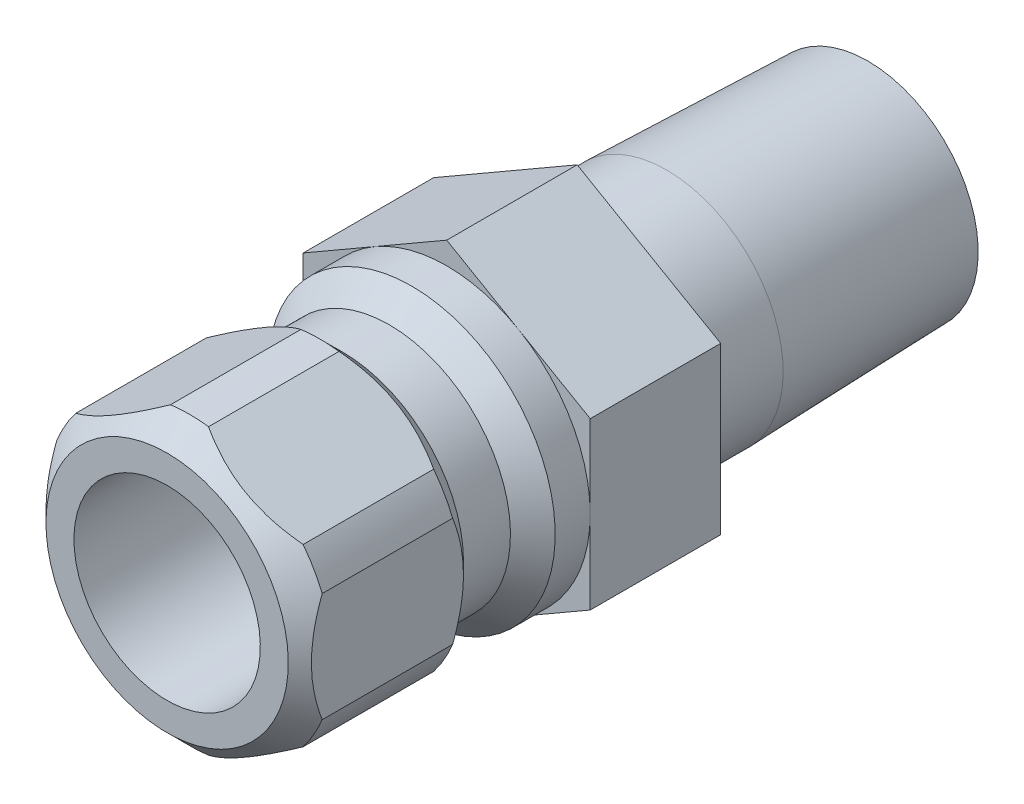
ISO-10303-21;
HEADER;
FILE_DESCRIPTION(('STEP AP214'),'2;1');
FILE_NAME('part.step','',(''),(''),'','','');
FILE_SCHEMA(('AUTOMOTIVE_DESIGN { 1 0 10303 214 1 1 1 1 }'));
ENDSEC;
DATA;
#1=APPLICATION_CONTEXT('core data for automotive mechanical design processes');
#2=APPLICATION_PROTOCOL_DEFINITION('international standard','automotive_design',2000,#1);
#3=PRODUCT_CONTEXT('',#1,'mechanical');
#4=PRODUCT('Part','Part','',(#3));
#5=PRODUCT_RELATED_PRODUCT_CATEGORY('part','',(#4));
#6=PRODUCT_DEFINITION_FORMATION('','',#4);
#7=PRODUCT_DEFINITION_CONTEXT('part definition',#1,'design');
#8=PRODUCT_DEFINITION('design','',#6,#7);
#9=PRODUCT_DEFINITION_SHAPE('','',#8);
#10=(LENGTH_UNIT() NAMED_UNIT(*) SI_UNIT(.MILLI.,.METRE.));
#11=(NAMED_UNIT(*) PLANE_ANGLE_UNIT() SI_UNIT($,.RADIAN.));
#12=(NAMED_UNIT(*) SI_UNIT($,.STERADIAN.) SOLID_ANGLE_UNIT());
#13=UNCERTAINTY_MEASURE_WITH_UNIT(LENGTH_MEASURE(1.E-05),#10,'distance_accuracy_value','');
#14=(GEOMETRIC_REPRESENTATION_CONTEXT(3) GLOBAL_UNCERTAINTY_ASSIGNED_CONTEXT((#13)) GLOBAL_UNIT_ASSIGNED_CONTEXT((#10,
#11,#12)) REPRESENTATION_CONTEXT('',''));
#15=CARTESIAN_POINT('',(0.,0.,0.));
#16=DIRECTION('',(0.,0.,1.));
#17=DIRECTION('',(1.,0.,0.));
#18=AXIS2_PLACEMENT_3D('',#15,#16,#17);
#19=CARTESIAN_POINT('',(0.,0.,0.));
#20=DIRECTION('',(0.,0.,-1.));
#21=DIRECTION('',(0.,1.,0.));
#22=AXIS2_PLACEMENT_3D('',#19,#20,#21);
#23=CYLINDRICAL_SURFACE('',#22,4.8895);
#24=DIRECTION('',(0.,0.,-1.));
#25=VECTOR('',#24,1.);
#26=CARTESIAN_POINT('',(-3.87288738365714,2.98461950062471,0.));
#27=LINE('',#26,#25);
#28=CARTESIAN_POINT('',(-3.87288738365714,2.98461950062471,4.318));
#29=VERTEX_POINT('',#28);
#30=CARTESIAN_POINT('',(-3.87288738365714,2.98461950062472,8.763));
#31=VERTEX_POINT('',#30);
#32=EDGE_CURVE('E54',#29,#31,#27,.F.);
#33=ORIENTED_EDGE('',*,*,#32,.F.);
#34=CARTESIAN_POINT('',(0.,0.,4.318));
#35=DIRECTION('',(0.,0.,-1.));
#36=DIRECTION('',(0.,1.,0.));
#37=AXIS2_PLACEMENT_3D('',#34,#35,#36);
#38=CIRCLE('',#37,4.8895);
#39=CARTESIAN_POINT('',(-4.5212,1.86170910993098,4.318));
#40=VERTEX_POINT('',#39);
#41=EDGE_CURVE('E213',#40,#29,#38,.T.);
#42=ORIENTED_EDGE('',*,*,#41,.F.);
#43=DIRECTION('',(0.,0.,-1.));
#44=VECTOR('',#43,1.);
#45=CARTESIAN_POINT('',(-4.5212,1.86170910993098,0.));
#46=LINE('',#45,#44);
#47=CARTESIAN_POINT('',(-4.5212,1.86170910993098,8.763));
#48=VERTEX_POINT('',#47);
#49=EDGE_CURVE('E428',#48,#40,#46,.T.);
#50=ORIENTED_EDGE('',*,*,#49,.F.);
#51=CARTESIAN_POINT('',(0.,0.,8.763));
#52=DIRECTION('',(0.,0.,-1.));
#53=DIRECTION('',(0.,1.,0.));
#54=AXIS2_PLACEMENT_3D('',#51,#52,#53);
#55=CIRCLE('',#54,4.8895);
#56=EDGE_CURVE('E218',#48,#31,#55,.T.);
#57=ORIENTED_EDGE('',*,*,#56,.T.);
#58=EDGE_LOOP('',(#33,#42,#50,#57));
#59=FACE_BOUND('',#58,.T.);
#60=ADVANCED_FACE('F35',(#59),#23,.T.);
#61=DIRECTION('',(0.,0.,-1.));
#62=VECTOR('',#61,1.);
#63=CARTESIAN_POINT('',(-4.5212,-1.86170910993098,0.));
#64=LINE('',#63,#62);
#65=CARTESIAN_POINT('',(-4.5212,-1.86170910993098,4.318));
#66=VERTEX_POINT('',#65);
#67=CARTESIAN_POINT('',(-4.5212,-1.86170910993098,8.763));
#68=VERTEX_POINT('',#67);
#69=EDGE_CURVE('E62',#66,#68,#64,.F.);
#70=ORIENTED_EDGE('',*,*,#69,.F.);
#71=CARTESIAN_POINT('',(-3.87288738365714,-2.98461950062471,4.318));
#72=VERTEX_POINT('',#71);
#73=EDGE_CURVE('E486',#72,#66,#38,.T.);
#74=ORIENTED_EDGE('',*,*,#73,.F.);
#75=DIRECTION('',(0.,0.,-1.));
#76=VECTOR('',#75,1.);
#77=CARTESIAN_POINT('',(-3.87288738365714,-2.98461950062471,0.));
#78=LINE('',#77,#76);
#79=CARTESIAN_POINT('',(-3.87288738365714,-2.98461950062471,8.763));
#80=VERTEX_POINT('',#79);
#81=EDGE_CURVE('E423',#80,#72,#78,.T.);
#82=ORIENTED_EDGE('',*,*,#81,.F.);
#83=EDGE_CURVE('E223',#80,#68,#55,.T.);
#84=ORIENTED_EDGE('',*,*,#83,.T.);
#85=EDGE_LOOP('',(#70,#74,#82,#84));
#86=FACE_BOUND('',#85,.T.);
#87=ADVANCED_FACE('F420',(#86),#23,.T.);
#88=DIRECTION('',(0.,0.,-1.));
#89=VECTOR('',#88,1.);
#90=CARTESIAN_POINT('',(-0.648312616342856,-4.84632861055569,0.));
#91=LINE('',#90,#89);
#92=CARTESIAN_POINT('',(-0.648312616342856,-4.84632861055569,4.318));
#93=VERTEX_POINT('',#92);
#94=CARTESIAN_POINT('',(-0.648312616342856,-4.84632861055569,8.763));
#95=VERTEX_POINT('',#94);
#96=EDGE_CURVE('E434',#93,#95,#91,.F.);
#97=ORIENTED_EDGE('',*,*,#96,.F.);
#98=CARTESIAN_POINT('',(0.648312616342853,-4.84632861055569,4.318));
#99=VERTEX_POINT('',#98);
#100=EDGE_CURVE('E484',#99,#93,#38,.T.);
#101=ORIENTED_EDGE('',*,*,#100,.F.);
#102=DIRECTION('',(0.,0.,-1.));
#103=VECTOR('',#102,1.);
#104=CARTESIAN_POINT('',(0.648312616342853,-4.84632861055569,0.));
#105=LINE('',#104,#103);
#106=CARTESIAN_POINT('',(0.648312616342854,-4.84632861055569,8.763));
#107=VERTEX_POINT('',#106);
#108=EDGE_CURVE('E470',#107,#99,#105,.T.);
#109=ORIENTED_EDGE('',*,*,#108,.F.);
#110=EDGE_CURVE('E216',#107,#95,#55,.T.);
#111=ORIENTED_EDGE('',*,*,#110,.T.);
#112=EDGE_LOOP('',(#97,#101,#109,#111));
#113=FACE_BOUND('',#112,.T.);
#114=ADVANCED_FACE('F483',(#113),#23,.T.);
#115=DIRECTION('',(0.,0.,-1.));
#116=VECTOR('',#115,1.);
#117=CARTESIAN_POINT('',(3.87288738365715,-2.98461950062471,0.));
#118=LINE('',#117,#116);
#119=CARTESIAN_POINT('',(3.87288738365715,-2.98461950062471,4.318));
#120=VERTEX_POINT('',#119);
#121=CARTESIAN_POINT('',(3.87288738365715,-2.98461950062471,8.763));
#122=VERTEX_POINT('',#121);
#123=EDGE_CURVE('E472',#120,#122,#118,.F.);
#124=ORIENTED_EDGE('',*,*,#123,.F.);
#125=CARTESIAN_POINT('',(4.5212,-1.86170910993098,4.318));
#126=VERTEX_POINT('',#125);
#127=EDGE_CURVE('E410',#126,#120,#38,.T.);
#128=ORIENTED_EDGE('',*,*,#127,.F.);
#129=DIRECTION('',(0.,0.,-1.));
#130=VECTOR('',#129,1.);
#131=CARTESIAN_POINT('',(4.5212,-1.86170910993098,0.));
#132=LINE('',#131,#130);
#133=CARTESIAN_POINT('',(4.5212,-1.86170910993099,8.763));
#134=VERTEX_POINT('',#133);
#135=EDGE_CURVE('E402',#134,#126,#132,.T.);
#136=ORIENTED_EDGE('',*,*,#135,.F.);
#137=EDGE_CURVE('E209',#134,#122,#55,.T.);
#138=ORIENTED_EDGE('',*,*,#137,.T.);
#139=EDGE_LOOP('',(#124,#128,#136,#138));
#140=FACE_BOUND('',#139,.T.);
#141=ADVANCED_FACE('F408',(#140),#23,.T.);
#142=DIRECTION('',(0.,0.,-1.));
#143=VECTOR('',#142,1.);
#144=CARTESIAN_POINT('',(4.5212,1.86170910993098,0.));
#145=LINE('',#144,#143);
#146=CARTESIAN_POINT('',(4.5212,1.86170910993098,4.318));
#147=VERTEX_POINT('',#146);
#148=CARTESIAN_POINT('',(4.5212,1.86170910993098,8.763));
#149=VERTEX_POINT('',#148);
#150=EDGE_CURVE('E404',#147,#149,#145,.F.);
#151=ORIENTED_EDGE('',*,*,#150,.F.);
#152=CARTESIAN_POINT('',(3.87288738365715,2.98461950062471,4.318));
#153=VERTEX_POINT('',#152);
#154=EDGE_CURVE('E202',#153,#147,#38,.T.);
#155=ORIENTED_EDGE('',*,*,#154,.F.);
#156=DIRECTION('',(0.,0.,-1.));
#157=VECTOR('',#156,1.);
#158=CARTESIAN_POINT('',(3.87288738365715,2.98461950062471,0.));
#159=LINE('',#158,#157);
#160=CARTESIAN_POINT('',(3.87288738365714,2.98461950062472,8.763));
#161=VERTEX_POINT('',#160);
#162=EDGE_CURVE('E184',#161,#153,#159,.T.);
#163=ORIENTED_EDGE('',*,*,#162,.F.);
#164=EDGE_CURVE('E200',#161,#149,#55,.T.);
#165=ORIENTED_EDGE('',*,*,#164,.T.);
#166=EDGE_LOOP('',(#151,#155,#163,#165));
#167=FACE_BOUND('',#166,.T.);
#168=ADVANCED_FACE('F199',(#167),#23,.T.);
#169=CARTESIAN_POINT('',(0.,0.,0.));
#170=DIRECTION('',(0.,0.,-1.));
#171=DIRECTION('',(0.,1.,0.));
#172=AXIS2_PLACEMENT_3D('',#169,#170,#171);
#173=CYLINDRICAL_SURFACE('',#172,4.8895);
#174=CARTESIAN_POINT('',(0.,0.,1.1938));
#175=DIRECTION('',(0.,0.,-1.));
#176=DIRECTION('',(0.,1.,0.));
#177=AXIS2_PLACEMENT_3D('',#174,#175,#176);
#178=CIRCLE('',#177,4.8895);
#179=CARTESIAN_POINT('',(0.,4.8895,1.1938));
#180=VERTEX_POINT('',#179);
#181=EDGE_CURVE('E494',#180,#180,#178,.T.);
#182=ORIENTED_EDGE('',*,*,#181,.T.);
#183=EDGE_LOOP('',(#182));
#184=FACE_BOUND('',#183,.T.);
#185=CARTESIAN_POINT('',(0.,0.,0.));
#186=DIRECTION('',(0.,0.,-1.));
#187=DIRECTION('',(0.,1.,0.));
#188=AXIS2_PLACEMENT_3D('',#185,#186,#187);
#189=CIRCLE('',#188,4.8895);
#190=CARTESIAN_POINT('',(2.44475,4.23443121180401,0.));
#191=VERTEX_POINT('',#190);
#192=CARTESIAN_POINT('',(4.8895,0.,0.));
#193=VERTEX_POINT('',#192);
#194=EDGE_CURVE('E497',#191,#193,#189,.T.);
#195=ORIENTED_EDGE('',*,*,#194,.F.);
#196=CARTESIAN_POINT('',(0.,0.,0.));
#197=DIRECTION('',(0.,0.,1.));
#198=DIRECTION('',(1.,0.,0.));
#199=AXIS2_PLACEMENT_3D('',#196,#197,#198);
#200=CIRCLE('',#199,4.8895);
#201=CARTESIAN_POINT('',(-2.44475,4.23443121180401,0.));
#202=VERTEX_POINT('',#201);
#203=EDGE_CURVE('E235',#202,#191,#200,.F.);
#204=ORIENTED_EDGE('',*,*,#203,.F.);
#205=CARTESIAN_POINT('',(-4.8895,0.,0.));
#206=VERTEX_POINT('',#205);
#207=EDGE_CURVE('E545',#206,#202,#200,.F.);
#208=ORIENTED_EDGE('',*,*,#207,.F.);
#209=CARTESIAN_POINT('',(-2.44475,-4.23443121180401,0.));
#210=VERTEX_POINT('',#209);
#211=EDGE_CURVE('E543',#210,#206,#200,.F.);
#212=ORIENTED_EDGE('',*,*,#211,.F.);
#213=CARTESIAN_POINT('',(2.44475,-4.23443121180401,0.));
#214=VERTEX_POINT('',#213);
#215=EDGE_CURVE('E234',#214,#210,#200,.F.);
#216=ORIENTED_EDGE('',*,*,#215,.F.);
#217=EDGE_CURVE('E231',#193,#214,#200,.F.);
#218=ORIENTED_EDGE('',*,*,#217,.F.);
#219=EDGE_LOOP('',(#195,#204,#208,#212,#216,#218));
#220=FACE_BOUND('',#219,.T.);
#221=ADVANCED_FACE('F548',(#184,#220),#173,.T.);
#222=CARTESIAN_POINT('',(0.,0.,1.1938));
#223=DIRECTION('',(0.,0.,-1.));
#224=DIRECTION('',(0.,1.,0.));
#225=AXIS2_PLACEMENT_3D('',#222,#223,#224);
#226=CONICAL_SURFACE('',#225,4.8895,0.785398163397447);
#227=CARTESIAN_POINT('',(0.,0.,1.9558));
#228=DIRECTION('',(0.,0.,-1.));
#229=DIRECTION('',(0.,1.,0.));
#230=AXIS2_PLACEMENT_3D('',#227,#228,#229);
#231=CIRCLE('',#230,4.1275);
#232=CARTESIAN_POINT('',(0.,4.1275,1.9558));
#233=VERTEX_POINT('',#232);
#234=EDGE_CURVE('E491',#233,#233,#231,.T.);
#235=ORIENTED_EDGE('',*,*,#234,.T.);
#236=EDGE_LOOP('',(#235));
#237=FACE_BOUND('',#236,.T.);
#238=ORIENTED_EDGE('',*,*,#181,.F.);
#239=EDGE_LOOP('',(#238));
#240=FACE_BOUND('',#239,.T.);
#241=ADVANCED_FACE('F550',(#237,#240),#226,.T.);
#242=CARTESIAN_POINT('',(0.,0.,0.));
#243=DIRECTION('',(0.,0.,-1.));
#244=DIRECTION('',(0.,1.,0.));
#245=AXIS2_PLACEMENT_3D('',#242,#243,#244);
#246=CYLINDRICAL_SURFACE('',#245,4.1275);
#247=CARTESIAN_POINT('',(0.,0.,3.556));
#248=DIRECTION('',(0.,0.,-1.));
#249=DIRECTION('',(0.,1.,0.));
#250=AXIS2_PLACEMENT_3D('',#247,#248,#249);
#251=CIRCLE('',#250,4.1275);
#252=CARTESIAN_POINT('',(0.,4.1275,3.556));
#253=VERTEX_POINT('',#252);
#254=EDGE_CURVE('E488',#253,#253,#251,.T.);
#255=ORIENTED_EDGE('',*,*,#254,.T.);
#256=EDGE_LOOP('',(#255));
#257=FACE_BOUND('',#256,.T.);
#258=ORIENTED_EDGE('',*,*,#234,.F.);
#259=EDGE_LOOP('',(#258));
#260=FACE_BOUND('',#259,.T.);
#261=ADVANCED_FACE('F557',(#257,#260),#246,.T.);
#262=CARTESIAN_POINT('',(0.,0.,3.556));
#263=DIRECTION('',(0.,0.,1.));
#264=DIRECTION('',(0.,-1.,0.));
#265=AXIS2_PLACEMENT_3D('',#262,#263,#264);
#266=CONICAL_SURFACE('',#265,4.1275,0.785398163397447);
#267=CARTESIAN_POINT('',(-0.647857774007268,4.84659121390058,4.3182));
#268=CARTESIAN_POINT('',(-0.775261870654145,4.77303442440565,4.26213711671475));
#269=CARTESIAN_POINT('',(-0.904457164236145,4.69844348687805,4.21102627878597));
#270=CARTESIAN_POINT('',(-1.16629518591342,4.5472712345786,4.12074318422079));
#271=CARTESIAN_POINT('',(-1.29894624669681,4.47068510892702,4.08160338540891));
#272=CARTESIAN_POINT('',(-1.56203676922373,4.31878972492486,4.01877592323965));
#273=CARTESIAN_POINT('',(-1.69238331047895,4.24353411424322,3.99458163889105));
#274=CARTESIAN_POINT('',(-1.95434729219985,4.09228913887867,3.96102228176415));
#275=CARTESIAN_POINT('',(-2.0859628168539,4.01630088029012,3.95163757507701));
#276=CARTESIAN_POINT('',(-2.35623055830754,3.86026172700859,3.9482192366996));
#277=CARTESIAN_POINT('',(-2.49489129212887,3.78020591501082,3.95501290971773));
#278=CARTESIAN_POINT('',(-2.7710334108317,3.62077518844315,3.98518499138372));
#279=CARTESIAN_POINT('',(-2.90851272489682,3.54140146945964,4.00858815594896));
#280=CARTESIAN_POINT('',(-3.18622016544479,3.38106700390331,4.07155129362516));
#281=CARTESIAN_POINT('',(-3.32634361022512,3.3001666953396,4.11171074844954));
#282=CARTESIAN_POINT('',(-3.60275664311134,3.14057955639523,4.20550294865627));
#283=CARTESIAN_POINT('',(-3.73905611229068,3.06188702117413,4.2590965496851));
#284=CARTESIAN_POINT('',(-3.87334222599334,2.98435689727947,4.31820000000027));
#285=B_SPLINE_CURVE_WITH_KNOTS('',3,(#267,#268,#269,#270,#271,#272,#273,#274,#275,#276,#277,
#278,#279,#280,#281,#282,#283,#284),.UNSPECIFIED.,.F.,.F.,(4,2,2,2,2,2,2,2,4),(0.,
0.472469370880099,0.946208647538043,1.40285320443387,1.85889185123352,2.33874707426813,
2.81931901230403,3.31879975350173,3.81684169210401),.UNSPECIFIED.);
#286=CARTESIAN_POINT('',(-0.648312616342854,4.84632861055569,4.318));
#287=VERTEX_POINT('',#286);
#288=EDGE_CURVE('E299',#287,#29,#285,.T.);
#289=ORIENTED_EDGE('',*,*,#288,.F.);
#290=CARTESIAN_POINT('',(0.648312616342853,4.84632861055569,4.318));
#291=VERTEX_POINT('',#290);
#292=EDGE_CURVE('E208',#287,#291,#38,.T.);
#293=ORIENTED_EDGE('',*,*,#292,.T.);
#294=CARTESIAN_POINT('',(3.87334222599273,2.98435689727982,4.3182));
#295=CARTESIAN_POINT('',(3.74593812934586,3.05791368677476,4.26213711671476));
#296=CARTESIAN_POINT('',(3.61674283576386,3.13250462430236,4.21102627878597));
#297=CARTESIAN_POINT('',(3.35490481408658,3.28367687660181,4.12074318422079));
#298=CARTESIAN_POINT('',(3.2222537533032,3.36026300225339,4.08160338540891));
#299=CARTESIAN_POINT('',(2.95916323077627,3.51215838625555,4.01877592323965));
#300=CARTESIAN_POINT('',(2.82881668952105,3.58741399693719,3.99458163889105));
#301=CARTESIAN_POINT('',(2.56685270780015,3.73865897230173,3.96102228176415));
#302=CARTESIAN_POINT('',(2.4352371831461,3.81464723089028,3.95163757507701));
#303=CARTESIAN_POINT('',(2.16496944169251,3.97068638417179,3.9482192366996));
#304=CARTESIAN_POINT('',(2.02630870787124,4.05074219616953,3.95501290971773));
#305=CARTESIAN_POINT('',(1.75016658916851,4.21017292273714,3.98518499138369));
#306=CARTESIAN_POINT('',(1.61268727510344,4.28954664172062,4.00858815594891));
#307=CARTESIAN_POINT('',(1.33497983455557,4.44988110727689,4.07155129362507));
#308=CARTESIAN_POINT('',(1.19485638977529,4.53078141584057,4.11171074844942));
#309=CARTESIAN_POINT('',(0.918443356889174,4.69036855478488,4.20550294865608));
#310=CARTESIAN_POINT('',(0.782143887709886,4.76906109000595,4.25909654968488));
#311=CARTESIAN_POINT('',(0.647857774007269,4.84659121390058,4.3182));
#312=B_SPLINE_CURVE_WITH_KNOTS('',3,(#294,#295,#296,#297,#298,#299,#300,#301,#302,#303,#304,
#305,#306,#307,#308,#309,#310,#311),.UNSPECIFIED.,.F.,.F.,(4,2,2,2,2,2,2,2,4),(0.,
0.472469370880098,0.946208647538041,1.40285320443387,1.85889185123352,2.33874707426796,
2.81931901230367,3.31879975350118,3.81684169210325),.UNSPECIFIED.);
#313=EDGE_CURVE('E411',#153,#291,#312,.T.);
#314=ORIENTED_EDGE('',*,*,#313,.F.);
#315=ORIENTED_EDGE('',*,*,#154,.T.);
#316=CARTESIAN_POINT('',(4.5212,-5.15925306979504,6.2884665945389));
#317=CARTESIAN_POINT('',(4.5212,-5.03341781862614,6.19384981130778));
#318=CARTESIAN_POINT('',(4.5212,-4.90687282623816,6.10016148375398));
#319=CARTESIAN_POINT('',(4.5212,-4.65208542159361,5.91505573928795));
#320=CARTESIAN_POINT('',(4.5212,-4.52384258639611,5.82363890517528));
#321=CARTESIAN_POINT('',(4.5212,-4.26444371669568,5.64284060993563));
#322=CARTESIAN_POINT('',(4.5212,-4.13327280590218,5.55348041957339));
#323=CARTESIAN_POINT('',(4.5212,-3.86869655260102,5.37814219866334));
#324=CARTESIAN_POINT('',(4.5212,-3.735291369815,5.2921639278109));
#325=CARTESIAN_POINT('',(4.5212,-3.45835736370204,5.1196421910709));
#326=CARTESIAN_POINT('',(4.5212,-3.31467977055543,5.03333631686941));
#327=CARTESIAN_POINT('',(4.5212,-3.02397608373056,4.86646929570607));
#328=CARTESIAN_POINT('',(4.5212,-2.87694947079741,4.78590904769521));
#329=CARTESIAN_POINT('',(4.5212,-2.57957206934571,4.63227577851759));
#330=CARTESIAN_POINT('',(4.5212,-2.42923274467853,4.55918074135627));
#331=CARTESIAN_POINT('',(4.5212,-2.12448469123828,4.4221138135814));
#332=CARTESIAN_POINT('',(4.5212,-1.97007782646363,4.35813782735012));
#333=CARTESIAN_POINT('',(4.5212,-1.66898205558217,4.24604782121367));
#334=CARTESIAN_POINT('',(4.5212,-1.52260919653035,4.19709368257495));
#335=CARTESIAN_POINT('',(4.5212,-1.22638031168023,4.11093488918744));
#336=CARTESIAN_POINT('',(4.5212,-1.07652404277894,4.07373105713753));
#337=CARTESIAN_POINT('',(4.5212,-0.776693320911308,4.01362130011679));
#338=CARTESIAN_POINT('',(4.5212,-0.626768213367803,3.99047322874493));
#339=CARTESIAN_POINT('',(4.5212,-0.325366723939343,3.95891692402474));
#340=CARTESIAN_POINT('',(4.5212,-0.173890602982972,3.95050625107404));
#341=CARTESIAN_POINT('',(4.5212,0.123852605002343,3.94903068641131));
#342=CARTESIAN_POINT('',(4.5212,0.27011728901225,3.95544130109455));
#343=CARTESIAN_POINT('',(4.5212,0.561370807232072,3.98210770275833));
#344=CARTESIAN_POINT('',(4.5212,0.706359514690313,4.0023648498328));
#345=CARTESIAN_POINT('',(4.5212,0.996462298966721,4.05597163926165));
#346=CARTESIAN_POINT('',(4.5212,1.14153485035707,4.08954247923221));
#347=CARTESIAN_POINT('',(4.5212,1.42852462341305,4.16800024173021));
#348=CARTESIAN_POINT('',(4.5212,1.5704421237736,4.21288616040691));
#349=CARTESIAN_POINT('',(4.5212,1.86505501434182,4.3171412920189));
#350=CARTESIAN_POINT('',(4.5212,2.01739126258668,4.377515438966));
#351=CARTESIAN_POINT('',(4.5212,2.318097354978,4.5075182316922));
#352=CARTESIAN_POINT('',(4.5212,2.46646529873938,4.57715121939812));
#353=CARTESIAN_POINT('',(4.5212,2.75996557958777,4.72401353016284));
#354=CARTESIAN_POINT('',(4.5212,2.90508583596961,4.80126680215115));
#355=CARTESIAN_POINT('',(4.5212,3.1919833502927,4.96166050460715));
#356=CARTESIAN_POINT('',(4.5212,3.33376113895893,5.04479999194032));
#357=CARTESIAN_POINT('',(4.5212,3.60742153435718,5.21154136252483));
#358=CARTESIAN_POINT('',(4.5212,3.73944496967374,5.29491333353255));
#359=CARTESIAN_POINT('',(4.5212,4.00122581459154,5.46515273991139));
#360=CARTESIAN_POINT('',(4.5212,4.13098305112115,5.55202044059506));
#361=CARTESIAN_POINT('',(4.5212,4.38747396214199,5.72790624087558));
#362=CARTESIAN_POINT('',(4.5212,4.51422365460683,5.81690106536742));
#363=CARTESIAN_POINT('',(4.5212,4.7659925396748,5.99723636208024));
#364=CARTESIAN_POINT('',(4.5212,4.89101219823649,6.08857618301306));
#365=CARTESIAN_POINT('',(4.5212,5.01530771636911,6.18087446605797));
#366=B_SPLINE_CURVE_WITH_KNOTS('',3,(#316,#317,#318,#319,#320,#321,#322,#323,#324,#325,#326,
#327,#328,#329,#330,#331,#332,#333,#334,#335,#336,#337,#338,#339,#340,#341,#342,#343,#344,#345,
#346,#347,#348,#349,#350,#351,#352,#353,#354,#355,#356,#357,#358,#359,#360,#361,#362,#363,#364,
#365),.UNSPECIFIED.,.F.,.F.,(4,2,2,2,2,2,2,2,2,2,2,2,2,2,2,2,2,2,2,2,2,2,2,2,4),(0.,
0.472324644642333,0.944769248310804,1.42087610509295,1.89694907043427,2.39966187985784,
2.90245317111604,3.40371602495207,3.90475303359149,4.36737130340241,4.83002195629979,
5.28445770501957,5.73881822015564,6.1773471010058,6.615919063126,7.06210522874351,
7.50825182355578,7.9994594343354,8.49089821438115,8.98393391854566,9.47689080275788,
9.94525924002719,10.4136632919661,10.8782525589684,11.3427141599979),.UNSPECIFIED.);
#367=EDGE_CURVE('E465',#126,#147,#366,.T.);
#368=ORIENTED_EDGE('',*,*,#367,.F.);
#369=ORIENTED_EDGE('',*,*,#127,.T.);
#370=CARTESIAN_POINT('',(0.64785777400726,-4.84659121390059,4.3182));
#371=CARTESIAN_POINT('',(0.775261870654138,-4.77303442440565,4.26213711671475));
#372=CARTESIAN_POINT('',(0.904457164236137,-4.69844348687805,4.21102627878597));
#373=CARTESIAN_POINT('',(1.16629518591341,-4.5472712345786,4.12074318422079));
#374=CARTESIAN_POINT('',(1.2989462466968,-4.47068510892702,4.08160338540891));
#375=CARTESIAN_POINT('',(1.56203676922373,-4.31878972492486,4.01877592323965));
#376=CARTESIAN_POINT('',(1.69238331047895,-4.24353411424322,3.99458163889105));
#377=CARTESIAN_POINT('',(1.95434729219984,-4.09228913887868,3.96102228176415));
#378=CARTESIAN_POINT('',(2.08596281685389,-4.01630088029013,3.951637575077));
#379=CARTESIAN_POINT('',(2.35623055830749,-3.86026172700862,3.9482192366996));
#380=CARTESIAN_POINT('',(2.49489129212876,-3.78020591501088,3.95501290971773));
#381=CARTESIAN_POINT('',(2.77103341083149,-3.62077518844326,3.98518499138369));
#382=CARTESIAN_POINT('',(2.90851272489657,-3.54140146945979,4.0085881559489));
#383=CARTESIAN_POINT('',(3.18622016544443,-3.38106700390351,4.07155129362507));
#384=CARTESIAN_POINT('',(3.32634361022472,-3.30016669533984,4.11171074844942));
#385=CARTESIAN_POINT('',(3.60275664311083,-3.14057955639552,4.20550294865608));
#386=CARTESIAN_POINT('',(3.73905611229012,-3.06188702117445,4.25909654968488));
#387=CARTESIAN_POINT('',(3.87334222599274,-2.98435689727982,4.3182));
#388=B_SPLINE_CURVE_WITH_KNOTS('',3,(#370,#371,#372,#373,#374,#375,#376,#377,#378,#379,#380,
#381,#382,#383,#384,#385,#386,#387),.UNSPECIFIED.,.F.,.F.,(4,2,2,2,2,2,2,2,4),(0.,
0.472469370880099,0.946208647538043,1.40285320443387,1.85889185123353,2.33874707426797,
2.81931901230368,3.31879975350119,3.81684169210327),.UNSPECIFIED.);
#389=EDGE_CURVE('E474',#99,#120,#388,.T.);
#390=ORIENTED_EDGE('',*,*,#389,.F.);
#391=ORIENTED_EDGE('',*,*,#100,.T.);
#392=CARTESIAN_POINT('',(-3.87334222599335,-2.98435689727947,4.31820000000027));
#393=CARTESIAN_POINT('',(-3.74593812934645,-3.05791368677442,4.262137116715));
#394=CARTESIAN_POINT('',(-3.61674283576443,-3.13250462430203,4.21102627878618));
#395=CARTESIAN_POINT('',(-3.35490481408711,-3.28367687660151,4.12074318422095));
#396=CARTESIAN_POINT('',(-3.2222537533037,-3.3602630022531,4.08160338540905));
#397=CARTESIAN_POINT('',(-2.95916323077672,-3.51215838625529,4.01877592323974));
#398=CARTESIAN_POINT('',(-2.82881668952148,-3.58741399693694,3.99458163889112));
#399=CARTESIAN_POINT('',(-2.56685270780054,-3.73865897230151,3.96102228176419));
#400=CARTESIAN_POINT('',(-2.43523718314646,-3.81464723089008,3.95163757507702));
#401=CARTESIAN_POINT('',(-2.16496944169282,-3.97068638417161,3.94821923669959));
#402=CARTESIAN_POINT('',(-2.02630870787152,-4.05074219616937,3.95501290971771));
#403=CARTESIAN_POINT('',(-1.75016658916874,-4.21017292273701,3.98518499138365));
#404=CARTESIAN_POINT('',(-1.61268727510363,-4.2895466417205,4.00858815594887));
#405=CARTESIAN_POINT('',(-1.33497983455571,-4.44988110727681,4.07155129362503));
#406=CARTESIAN_POINT('',(-1.1948563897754,-4.5307814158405,4.11171074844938));
#407=CARTESIAN_POINT('',(-0.918443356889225,-4.69036855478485,4.20550294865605));
#408=CARTESIAN_POINT('',(-0.782143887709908,-4.76906109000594,4.25909654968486));
#409=CARTESIAN_POINT('',(-0.647857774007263,-4.84659121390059,4.3182));
#410=B_SPLINE_CURVE_WITH_KNOTS('',3,(#392,#393,#394,#395,#396,#397,#398,#399,#400,#401,#402,
#403,#404,#405,#406,#407,#408,#409),.UNSPECIFIED.,.F.,.F.,(4,2,2,2,2,2,2,2,4),(0.,
0.472469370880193,0.946208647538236,1.40285320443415,1.85889185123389,2.33874707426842,
2.81931901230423,3.31879975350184,3.81684169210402),.UNSPECIFIED.);
#411=EDGE_CURVE('E430',#72,#93,#410,.T.);
#412=ORIENTED_EDGE('',*,*,#411,.F.);
#413=ORIENTED_EDGE('',*,*,#73,.T.);
#414=CARTESIAN_POINT('',(-4.5212,-5.15925306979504,6.2884665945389));
#415=CARTESIAN_POINT('',(-4.5212,-5.03341781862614,6.19384981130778));
#416=CARTESIAN_POINT('',(-4.5212,-4.90687282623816,6.10016148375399));
#417=CARTESIAN_POINT('',(-4.5212,-4.65208542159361,5.91505573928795));
#418=CARTESIAN_POINT('',(-4.5212,-4.52384258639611,5.82363890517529));
#419=CARTESIAN_POINT('',(-4.5212,-4.26444371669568,5.64284060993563));
#420=CARTESIAN_POINT('',(-4.5212,-4.13327280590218,5.55348041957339));
#421=CARTESIAN_POINT('',(-4.5212,-3.86869655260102,5.37814219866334));
#422=CARTESIAN_POINT('',(-4.5212,-3.735291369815,5.29216392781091));
#423=CARTESIAN_POINT('',(-4.5212,-3.45835736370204,5.1196421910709));
#424=CARTESIAN_POINT('',(-4.5212,-3.31467977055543,5.03333631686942));
#425=CARTESIAN_POINT('',(-4.5212,-3.02397608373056,4.86646929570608));
#426=CARTESIAN_POINT('',(-4.5212,-2.87694947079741,4.78590904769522));
#427=CARTESIAN_POINT('',(-4.5212,-2.57957206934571,4.6322757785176));
#428=CARTESIAN_POINT('',(-4.5212,-2.42923274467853,4.55918074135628));
#429=CARTESIAN_POINT('',(-4.5212,-2.12448469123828,4.42211381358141));
#430=CARTESIAN_POINT('',(-4.5212,-1.97007782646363,4.35813782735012));
#431=CARTESIAN_POINT('',(-4.5212,-1.66898205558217,4.24604782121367));
#432=CARTESIAN_POINT('',(-4.5212,-1.52260919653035,4.19709368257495));
#433=CARTESIAN_POINT('',(-4.5212,-1.22638031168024,4.11093488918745));
#434=CARTESIAN_POINT('',(-4.5212,-1.07652404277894,4.07373105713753));
#435=CARTESIAN_POINT('',(-4.5212,-0.776693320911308,4.01362130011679));
#436=CARTESIAN_POINT('',(-4.5212,-0.626768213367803,3.99047322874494));
#437=CARTESIAN_POINT('',(-4.5212,-0.325366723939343,3.95891692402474));
#438=CARTESIAN_POINT('',(-4.5212,-0.173890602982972,3.95050625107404));
#439=CARTESIAN_POINT('',(-4.5212,0.123852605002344,3.94903068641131));
#440=CARTESIAN_POINT('',(-4.5212,0.270117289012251,3.95544130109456));
#441=CARTESIAN_POINT('',(-4.5212,0.561370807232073,3.98210770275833));
#442=CARTESIAN_POINT('',(-4.5212,0.706359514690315,4.0023648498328));
#443=CARTESIAN_POINT('',(-4.5212,0.996462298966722,4.05597163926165));
#444=CARTESIAN_POINT('',(-4.5212,1.14153485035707,4.08954247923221));
#445=CARTESIAN_POINT('',(-4.5212,1.42852462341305,4.16800024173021));
#446=CARTESIAN_POINT('',(-4.5212,1.5704421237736,4.21288616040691));
#447=CARTESIAN_POINT('',(-4.5212,1.86505501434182,4.3171412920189));
#448=CARTESIAN_POINT('',(-4.5212,2.01739126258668,4.37751543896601));
#449=CARTESIAN_POINT('',(-4.5212,2.318097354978,4.5075182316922));
#450=CARTESIAN_POINT('',(-4.5212,2.46646529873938,4.57715121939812));
#451=CARTESIAN_POINT('',(-4.5212,2.75996557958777,4.72401353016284));
#452=CARTESIAN_POINT('',(-4.5212,2.90508583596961,4.80126680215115));
#453=CARTESIAN_POINT('',(-4.5212,3.1919833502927,4.96166050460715));
#454=CARTESIAN_POINT('',(-4.5212,3.33376113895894,5.04479999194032));
#455=CARTESIAN_POINT('',(-4.5212,3.60742153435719,5.21154136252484));
#456=CARTESIAN_POINT('',(-4.5212,3.73944496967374,5.29491333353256));
#457=CARTESIAN_POINT('',(-4.5212,4.00122581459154,5.4651527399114));
#458=CARTESIAN_POINT('',(-4.5212,4.13098305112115,5.55202044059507));
#459=CARTESIAN_POINT('',(-4.5212,4.38747396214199,5.72790624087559));
#460=CARTESIAN_POINT('',(-4.5212,4.51422365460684,5.81690106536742));
#461=CARTESIAN_POINT('',(-4.5212,4.76599253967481,5.99723636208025));
#462=CARTESIAN_POINT('',(-4.5212,4.8910121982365,6.08857618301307));
#463=CARTESIAN_POINT('',(-4.5212,5.01530771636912,6.18087446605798));
#464=B_SPLINE_CURVE_WITH_KNOTS('',3,(#414,#415,#416,#417,#418,#419,#420,#421,#422,#423,#424,
#425,#426,#427,#428,#429,#430,#431,#432,#433,#434,#435,#436,#437,#438,#439,#440,#441,#442,#443,
#444,#445,#446,#447,#448,#449,#450,#451,#452,#453,#454,#455,#456,#457,#458,#459,#460,#461,#462,
#463),.UNSPECIFIED.,.F.,.F.,(4,2,2,2,2,2,2,2,2,2,2,2,2,2,2,2,2,2,2,2,2,2,2,2,4),(0.,
0.472324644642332,0.944769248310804,1.42087610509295,1.89694907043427,2.39966187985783,
2.90245317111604,3.40371602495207,3.90475303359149,4.36737130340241,4.83002195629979,
5.28445770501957,5.73881822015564,6.1773471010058,6.615919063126,7.06210522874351,
7.50825182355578,7.9994594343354,8.49089821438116,8.98393391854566,9.47689080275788,
9.94525924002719,10.4136632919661,10.8782525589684,11.3427141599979),.UNSPECIFIED.);
#465=EDGE_CURVE('E432',#40,#66,#464,.F.);
#466=ORIENTED_EDGE('',*,*,#465,.F.);
#467=ORIENTED_EDGE('',*,*,#41,.T.);
#468=EDGE_LOOP('',(#289,#293,#314,#315,#368,#369,#390,#391,#412,#413,#466,#467));
#469=FACE_BOUND('',#468,.T.);
#470=ORIENTED_EDGE('',*,*,#254,.F.);
#471=EDGE_LOOP('',(#470));
#472=FACE_BOUND('',#471,.T.);
#473=ADVANCED_FACE('F306',(#469,#472),#266,.T.);
#474=DIRECTION('',(0.,0.,-1.));
#475=VECTOR('',#474,1.);
#476=CARTESIAN_POINT('',(-0.648312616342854,4.84632861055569,0.));
#477=LINE('',#476,#475);
#478=CARTESIAN_POINT('',(-0.648312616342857,4.84632861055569,8.763));
#479=VERTEX_POINT('',#478);
#480=EDGE_CURVE('E444',#479,#287,#477,.T.);
#481=ORIENTED_EDGE('',*,*,#480,.F.);
#482=CARTESIAN_POINT('',(0.648312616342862,4.84632861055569,8.763));
#483=VERTEX_POINT('',#482);
#484=EDGE_CURVE('E211',#479,#483,#55,.T.);
#485=ORIENTED_EDGE('',*,*,#484,.T.);
#486=DIRECTION('',(0.,0.,-1.));
#487=VECTOR('',#486,1.);
#488=CARTESIAN_POINT('',(0.648312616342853,4.84632861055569,0.));
#489=LINE('',#488,#487);
#490=EDGE_CURVE('E187',#291,#483,#489,.F.);
#491=ORIENTED_EDGE('',*,*,#490,.F.);
#492=ORIENTED_EDGE('',*,*,#292,.F.);
#493=EDGE_LOOP('',(#481,#485,#491,#492));
#494=FACE_BOUND('',#493,.T.);
#495=ADVANCED_FACE('F362',(#494),#23,.T.);
#496=CARTESIAN_POINT('',(0.,0.,8.763));
#497=DIRECTION('',(0.,0.,-1.));
#498=DIRECTION('',(0.,1.,0.));
#499=AXIS2_PLACEMENT_3D('',#496,#497,#498);
#500=CONICAL_SURFACE('',#499,4.8895,0.785398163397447);
#501=CARTESIAN_POINT('',(-3.87334222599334,2.98435689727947,8.76279999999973));
#502=CARTESIAN_POINT('',(-3.74593812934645,3.05791368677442,8.818862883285));
#503=CARTESIAN_POINT('',(-3.61674283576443,3.13250462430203,8.86997372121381));
#504=CARTESIAN_POINT('',(-3.35490481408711,3.28367687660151,8.96025681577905));
#505=CARTESIAN_POINT('',(-3.2222537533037,3.3602630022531,8.99939661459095));
#506=CARTESIAN_POINT('',(-2.95916323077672,3.51215838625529,9.06222407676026));
#507=CARTESIAN_POINT('',(-2.82881668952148,3.58741399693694,9.08641836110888));
#508=CARTESIAN_POINT('',(-2.56685270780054,3.73865897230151,9.11997771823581));
#509=CARTESIAN_POINT('',(-2.43523718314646,3.81464723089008,9.12936242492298));
#510=CARTESIAN_POINT('',(-2.16496944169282,3.97068638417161,9.13278076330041));
#511=CARTESIAN_POINT('',(-2.02630870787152,4.05074219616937,9.12598709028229));
#512=CARTESIAN_POINT('',(-1.75016658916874,4.21017292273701,9.09581500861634));
#513=CARTESIAN_POINT('',(-1.61268727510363,4.2895466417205,9.07241184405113));
#514=CARTESIAN_POINT('',(-1.33497983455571,4.44988110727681,9.00944870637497));
#515=CARTESIAN_POINT('',(-1.1948563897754,4.5307814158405,8.96928925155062));
#516=CARTESIAN_POINT('',(-0.918443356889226,4.69036855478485,8.87549705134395));
#517=CARTESIAN_POINT('',(-0.782143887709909,4.76906109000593,8.82190345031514));
#518=CARTESIAN_POINT('',(-0.647857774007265,4.84659121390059,8.7628));
#519=B_SPLINE_CURVE_WITH_KNOTS('',3,(#501,#502,#503,#504,#505,#506,#507,#508,#509,#510,#511,
#512,#513,#514,#515,#516,#517,#518),.UNSPECIFIED.,.F.,.F.,(4,2,2,2,2,2,2,2,4),(0.,
0.472469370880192,0.946208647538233,1.40285320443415,1.85889185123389,2.33874707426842,
2.81931901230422,3.31879975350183,3.81684169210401),.UNSPECIFIED.);
#520=EDGE_CURVE('E13',#31,#479,#519,.T.);
#521=ORIENTED_EDGE('',*,*,#520,.F.);
#522=ORIENTED_EDGE('',*,*,#56,.F.);
#523=CARTESIAN_POINT('',(-4.5212,-5.15925306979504,6.7925334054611));
#524=CARTESIAN_POINT('',(-4.5212,-5.03341781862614,6.88715018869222));
#525=CARTESIAN_POINT('',(-4.5212,-4.90687282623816,6.98083851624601));
#526=CARTESIAN_POINT('',(-4.5212,-4.65208542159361,7.16594426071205));
#527=CARTESIAN_POINT('',(-4.5212,-4.52384258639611,7.25736109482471));
#528=CARTESIAN_POINT('',(-4.5212,-4.26444371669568,7.43815939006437));
#529=CARTESIAN_POINT('',(-4.5212,-4.13327280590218,7.52751958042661));
#530=CARTESIAN_POINT('',(-4.5212,-3.86869655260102,7.70285780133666));
#531=CARTESIAN_POINT('',(-4.5212,-3.73529136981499,7.78883607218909));
#532=CARTESIAN_POINT('',(-4.5212,-3.45835736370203,7.9613578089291));
#533=CARTESIAN_POINT('',(-4.5212,-3.31467977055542,8.04766368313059));
#534=CARTESIAN_POINT('',(-4.5212,-3.02397608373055,8.21453070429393));
#535=CARTESIAN_POINT('',(-4.5212,-2.87694947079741,8.29509095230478));
#536=CARTESIAN_POINT('',(-4.5212,-2.57957206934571,8.4487242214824));
#537=CARTESIAN_POINT('',(-4.5212,-2.42923274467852,8.52181925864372));
#538=CARTESIAN_POINT('',(-4.5212,-2.12448469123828,8.6588861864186));
#539=CARTESIAN_POINT('',(-4.5212,-1.97007782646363,8.72286217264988));
#540=CARTESIAN_POINT('',(-4.5212,-1.66898205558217,8.83495217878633));
#541=CARTESIAN_POINT('',(-4.5212,-1.52260919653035,8.88390631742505));
#542=CARTESIAN_POINT('',(-4.5212,-1.22638031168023,8.97006511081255));
#543=CARTESIAN_POINT('',(-4.5212,-1.07652404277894,9.00726894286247));
#544=CARTESIAN_POINT('',(-4.5212,-0.776693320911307,9.06737869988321));
#545=CARTESIAN_POINT('',(-4.5212,-0.626768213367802,9.09052677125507));
#546=CARTESIAN_POINT('',(-4.5212,-0.325366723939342,9.12208307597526));
#547=CARTESIAN_POINT('',(-4.5212,-0.173890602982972,9.13049374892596));
#548=CARTESIAN_POINT('',(-4.5212,0.123852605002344,9.13196931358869));
#549=CARTESIAN_POINT('',(-4.5212,0.270117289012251,9.12555869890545));
#550=CARTESIAN_POINT('',(-4.5212,0.561370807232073,9.09889229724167));
#551=CARTESIAN_POINT('',(-4.5212,0.706359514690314,9.0786351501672));
#552=CARTESIAN_POINT('',(-4.5212,0.996462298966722,9.02502836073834));
#553=CARTESIAN_POINT('',(-4.5212,1.14153485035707,8.99145752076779));
#554=CARTESIAN_POINT('',(-4.5212,1.42852462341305,8.91299975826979));
#555=CARTESIAN_POINT('',(-4.5212,1.5704421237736,8.86811383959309));
#556=CARTESIAN_POINT('',(-4.5212,1.86505501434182,8.7638587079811));
#557=CARTESIAN_POINT('',(-4.5212,2.01739126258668,8.70348456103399));
#558=CARTESIAN_POINT('',(-4.5212,2.318097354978,8.5734817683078));
#559=CARTESIAN_POINT('',(-4.5212,2.46646529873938,8.50384878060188));
#560=CARTESIAN_POINT('',(-4.5212,2.75996557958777,8.35698646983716));
#561=CARTESIAN_POINT('',(-4.5212,2.90508583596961,8.27973319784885));
#562=CARTESIAN_POINT('',(-4.5212,3.1919833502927,8.11933949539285));
#563=CARTESIAN_POINT('',(-4.5212,3.33376113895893,8.03620000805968));
#564=CARTESIAN_POINT('',(-4.5212,3.60742153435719,7.86945863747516));
#565=CARTESIAN_POINT('',(-4.5212,3.73944496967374,7.78608666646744));
#566=CARTESIAN_POINT('',(-4.5212,4.00122581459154,7.6158472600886));
#567=CARTESIAN_POINT('',(-4.5212,4.13098305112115,7.52897955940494));
#568=CARTESIAN_POINT('',(-4.5212,4.38747396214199,7.35309375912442));
#569=CARTESIAN_POINT('',(-4.5212,4.51422365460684,7.26409893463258));
#570=CARTESIAN_POINT('',(-4.5212,4.76599253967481,7.08376363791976));
#571=CARTESIAN_POINT('',(-4.5212,4.8910121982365,6.99242381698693));
#572=CARTESIAN_POINT('',(-4.5212,5.01530771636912,6.90012553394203));
#573=B_SPLINE_CURVE_WITH_KNOTS('',3,(#523,#524,#525,#526,#527,#528,#529,#530,#531,#532,#533,
#534,#535,#536,#537,#538,#539,#540,#541,#542,#543,#544,#545,#546,#547,#548,#549,#550,#551,#552,
#553,#554,#555,#556,#557,#558,#559,#560,#561,#562,#563,#564,#565,#566,#567,#568,#569,#570,#571,
#572),.UNSPECIFIED.,.F.,.F.,(4,2,2,2,2,2,2,2,2,2,2,2,2,2,2,2,2,2,2,2,2,2,2,2,4),(0.,
0.472324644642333,0.944769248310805,1.42087610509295,1.89694907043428,2.39966187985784,
2.90245317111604,3.40371602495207,3.90475303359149,4.36737130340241,4.83002195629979,
5.28445770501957,5.73881822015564,6.1773471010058,6.615919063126,7.06210522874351,
7.50825182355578,7.9994594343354,8.49089821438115,8.98393391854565,9.47689080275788,
9.94525924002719,10.4136632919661,10.8782525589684,11.3427141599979),.UNSPECIFIED.);
#574=EDGE_CURVE('E48',#68,#48,#573,.T.);
#575=ORIENTED_EDGE('',*,*,#574,.F.);
#576=ORIENTED_EDGE('',*,*,#83,.F.);
#577=CARTESIAN_POINT('',(-0.647857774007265,-4.84659121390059,8.7628));
#578=CARTESIAN_POINT('',(-0.775261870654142,-4.77303442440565,8.81886288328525));
#579=CARTESIAN_POINT('',(-0.904457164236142,-4.69844348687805,8.86997372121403));
#580=CARTESIAN_POINT('',(-1.16629518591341,-4.5472712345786,8.96025681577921));
#581=CARTESIAN_POINT('',(-1.2989462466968,-4.47068510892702,8.99939661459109));
#582=CARTESIAN_POINT('',(-1.56203676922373,-4.31878972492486,9.06222407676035));
#583=CARTESIAN_POINT('',(-1.69238331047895,-4.24353411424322,9.08641836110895));
#584=CARTESIAN_POINT('',(-1.95434729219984,-4.09228913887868,9.11997771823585));
#585=CARTESIAN_POINT('',(-2.0859628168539,-4.01630088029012,9.12936242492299));
#586=CARTESIAN_POINT('',(-2.35623055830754,-3.86026172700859,9.1327807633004));
#587=CARTESIAN_POINT('',(-2.49489129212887,-3.78020591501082,9.12598709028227));
#588=CARTESIAN_POINT('',(-2.7710334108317,-3.62077518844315,9.09581500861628));
#589=CARTESIAN_POINT('',(-2.90851272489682,-3.54140146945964,9.07241184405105));
#590=CARTESIAN_POINT('',(-3.18622016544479,-3.38106700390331,9.00944870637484));
#591=CARTESIAN_POINT('',(-3.32634361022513,-3.3001666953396,8.96928925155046));
#592=CARTESIAN_POINT('',(-3.60275664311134,-3.14057955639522,8.87549705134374));
#593=CARTESIAN_POINT('',(-3.73905611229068,-3.06188702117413,8.8219034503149));
#594=CARTESIAN_POINT('',(-3.87334222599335,-2.98435689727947,8.76279999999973));
#595=B_SPLINE_CURVE_WITH_KNOTS('',3,(#577,#578,#579,#580,#581,#582,#583,#584,#585,#586,#587,
#588,#589,#590,#591,#592,#593,#594),.UNSPECIFIED.,.F.,.F.,(4,2,2,2,2,2,2,2,4),(0.,
0.472469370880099,0.946208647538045,1.40285320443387,1.85889185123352,2.33874707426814,
2.81931901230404,3.31879975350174,3.81684169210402),.UNSPECIFIED.);
#596=EDGE_CURVE('E385',#95,#80,#595,.T.);
#597=ORIENTED_EDGE('',*,*,#596,.F.);
#598=ORIENTED_EDGE('',*,*,#110,.F.);
#599=CARTESIAN_POINT('',(3.87334222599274,-2.98435689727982,8.7628));
#600=CARTESIAN_POINT('',(3.74593812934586,-3.05791368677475,8.81886288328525));
#601=CARTESIAN_POINT('',(3.61674283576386,-3.13250462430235,8.86997372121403));
#602=CARTESIAN_POINT('',(3.35490481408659,-3.28367687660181,8.96025681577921));
#603=CARTESIAN_POINT('',(3.2222537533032,-3.36026300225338,8.99939661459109));
#604=CARTESIAN_POINT('',(2.95916323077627,-3.51215838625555,9.06222407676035));
#605=CARTESIAN_POINT('',(2.82881668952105,-3.58741399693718,9.08641836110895));
#606=CARTESIAN_POINT('',(2.56685270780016,-3.73865897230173,9.11997771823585));
#607=CARTESIAN_POINT('',(2.43523718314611,-3.81464723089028,9.129362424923));
#608=CARTESIAN_POINT('',(2.16496944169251,-3.97068638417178,9.1327807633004));
#609=CARTESIAN_POINT('',(2.02630870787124,-4.05074219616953,9.12598709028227));
#610=CARTESIAN_POINT('',(1.75016658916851,-4.21017292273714,9.09581500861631));
#611=CARTESIAN_POINT('',(1.61268727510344,-4.28954664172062,9.07241184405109));
#612=CARTESIAN_POINT('',(1.33497983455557,-4.44988110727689,9.00944870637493));
#613=CARTESIAN_POINT('',(1.19485638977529,-4.53078141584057,8.96928925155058));
#614=CARTESIAN_POINT('',(0.918443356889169,-4.69036855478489,8.87549705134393));
#615=CARTESIAN_POINT('',(0.782143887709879,-4.76906109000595,8.82190345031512));
#616=CARTESIAN_POINT('',(0.647857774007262,-4.84659121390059,8.7628));
#617=B_SPLINE_CURVE_WITH_KNOTS('',3,(#599,#600,#601,#602,#603,#604,#605,#606,#607,#608,#609,
#610,#611,#612,#613,#614,#615,#616),.UNSPECIFIED.,.F.,.F.,(4,2,2,2,2,2,2,2,4),(0.,
0.472469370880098,0.946208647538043,1.40285320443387,1.85889185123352,2.33874707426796,
2.81931901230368,3.31879975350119,3.81684169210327),.UNSPECIFIED.);
#618=EDGE_CURVE('E379',#122,#107,#617,.T.);
#619=ORIENTED_EDGE('',*,*,#618,.F.);
#620=ORIENTED_EDGE('',*,*,#137,.F.);
#621=CARTESIAN_POINT('',(4.5212,-5.15925306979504,6.7925334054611));
#622=CARTESIAN_POINT('',(4.5212,-5.03341781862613,6.88715018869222));
#623=CARTESIAN_POINT('',(4.5212,-4.90687282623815,6.98083851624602));
#624=CARTESIAN_POINT('',(4.5212,-4.65208542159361,7.16594426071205));
#625=CARTESIAN_POINT('',(4.5212,-4.52384258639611,7.25736109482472));
#626=CARTESIAN_POINT('',(4.5212,-4.26444371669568,7.43815939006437));
#627=CARTESIAN_POINT('',(4.5212,-4.13327280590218,7.52751958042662));
#628=CARTESIAN_POINT('',(4.5212,-3.86869655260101,7.70285780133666));
#629=CARTESIAN_POINT('',(4.5212,-3.73529136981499,7.7888360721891));
#630=CARTESIAN_POINT('',(4.5212,-3.45835736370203,7.9613578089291));
#631=CARTESIAN_POINT('',(4.5212,-3.31467977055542,8.04766368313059));
#632=CARTESIAN_POINT('',(4.5212,-3.02397608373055,8.21453070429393));
#633=CARTESIAN_POINT('',(4.5212,-2.87694947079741,8.29509095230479));
#634=CARTESIAN_POINT('',(4.5212,-2.57957206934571,8.44872422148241));
#635=CARTESIAN_POINT('',(4.5212,-2.42923274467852,8.52181925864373));
#636=CARTESIAN_POINT('',(4.5212,-2.12448469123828,8.6588861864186));
#637=CARTESIAN_POINT('',(4.5212,-1.97007782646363,8.72286217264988));
#638=CARTESIAN_POINT('',(4.5212,-1.66898205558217,8.83495217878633));
#639=CARTESIAN_POINT('',(4.5212,-1.52260919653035,8.88390631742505));
#640=CARTESIAN_POINT('',(4.5212,-1.22638031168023,8.97006511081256));
#641=CARTESIAN_POINT('',(4.5212,-1.07652404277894,9.00726894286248));
#642=CARTESIAN_POINT('',(4.5212,-0.776693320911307,9.06737869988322));
#643=CARTESIAN_POINT('',(4.5212,-0.626768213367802,9.09052677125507));
#644=CARTESIAN_POINT('',(4.5212,-0.325366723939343,9.12208307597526));
#645=CARTESIAN_POINT('',(4.5212,-0.173890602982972,9.13049374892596));
#646=CARTESIAN_POINT('',(4.5212,0.123852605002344,9.13196931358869));
#647=CARTESIAN_POINT('',(4.5212,0.270117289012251,9.12555869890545));
#648=CARTESIAN_POINT('',(4.5212,0.561370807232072,9.09889229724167));
#649=CARTESIAN_POINT('',(4.5212,0.706359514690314,9.0786351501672));
#650=CARTESIAN_POINT('',(4.5212,0.996462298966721,9.02502836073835));
#651=CARTESIAN_POINT('',(4.5212,1.14153485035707,8.99145752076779));
#652=CARTESIAN_POINT('',(4.5212,1.42852462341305,8.91299975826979));
#653=CARTESIAN_POINT('',(4.5212,1.5704421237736,8.86811383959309));
#654=CARTESIAN_POINT('',(4.5212,1.86505501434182,8.76385870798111));
#655=CARTESIAN_POINT('',(4.5212,2.01739126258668,8.703484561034));
#656=CARTESIAN_POINT('',(4.5212,2.318097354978,8.57348176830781));
#657=CARTESIAN_POINT('',(4.5212,2.46646529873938,8.50384878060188));
#658=CARTESIAN_POINT('',(4.5212,2.75996557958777,8.35698646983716));
#659=CARTESIAN_POINT('',(4.5212,2.9050858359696,8.27973319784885));
#660=CARTESIAN_POINT('',(4.5212,3.1919833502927,8.11933949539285));
#661=CARTESIAN_POINT('',(4.5212,3.33376113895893,8.03620000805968));
#662=CARTESIAN_POINT('',(4.5212,3.60742153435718,7.86945863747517));
#663=CARTESIAN_POINT('',(4.5212,3.73944496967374,7.78608666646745));
#664=CARTESIAN_POINT('',(4.5212,4.00122581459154,7.61584726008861));
#665=CARTESIAN_POINT('',(4.5212,4.13098305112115,7.52897955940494));
#666=CARTESIAN_POINT('',(4.5212,4.38747396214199,7.35309375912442));
#667=CARTESIAN_POINT('',(4.5212,4.51422365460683,7.26409893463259));
#668=CARTESIAN_POINT('',(4.5212,4.7659925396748,7.08376363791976));
#669=CARTESIAN_POINT('',(4.5212,4.89101219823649,6.99242381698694));
#670=CARTESIAN_POINT('',(4.5212,5.01530771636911,6.90012553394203));
#671=B_SPLINE_CURVE_WITH_KNOTS('',3,(#621,#622,#623,#624,#625,#626,#627,#628,#629,#630,#631,
#632,#633,#634,#635,#636,#637,#638,#639,#640,#641,#642,#643,#644,#645,#646,#647,#648,#649,#650,
#651,#652,#653,#654,#655,#656,#657,#658,#659,#660,#661,#662,#663,#664,#665,#666,#667,#668,#669,
#670),.UNSPECIFIED.,.F.,.F.,(4,2,2,2,2,2,2,2,2,2,2,2,2,2,2,2,2,2,2,2,2,2,2,2,4),(0.,
0.472324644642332,0.944769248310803,1.42087610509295,1.89694907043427,2.39966187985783,
2.90245317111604,3.40371602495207,3.90475303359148,4.3673713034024,4.83002195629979,
5.28445770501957,5.73881822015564,6.17734710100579,6.615919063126,7.0621052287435,
7.50825182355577,7.9994594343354,8.49089821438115,8.98393391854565,9.47689080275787,
9.94525924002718,10.4136632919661,10.8782525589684,11.3427141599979),.UNSPECIFIED.);
#672=EDGE_CURVE('E192',#149,#134,#671,.F.);
#673=ORIENTED_EDGE('',*,*,#672,.F.);
#674=ORIENTED_EDGE('',*,*,#164,.F.);
#675=CARTESIAN_POINT('',(0.647857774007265,4.84659121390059,8.7628));
#676=CARTESIAN_POINT('',(0.775261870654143,4.77303442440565,8.81886288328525));
#677=CARTESIAN_POINT('',(0.904457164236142,4.69844348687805,8.86997372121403));
#678=CARTESIAN_POINT('',(1.16629518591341,4.5472712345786,8.96025681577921));
#679=CARTESIAN_POINT('',(1.2989462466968,4.47068510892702,8.99939661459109));
#680=CARTESIAN_POINT('',(1.56203676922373,4.31878972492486,9.06222407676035));
#681=CARTESIAN_POINT('',(1.69238331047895,4.24353411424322,9.08641836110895));
#682=CARTESIAN_POINT('',(1.95434729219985,4.09228913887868,9.11997771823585));
#683=CARTESIAN_POINT('',(2.0859628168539,4.01630088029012,9.12936242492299));
#684=CARTESIAN_POINT('',(2.35623055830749,3.86026172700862,9.1327807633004));
#685=CARTESIAN_POINT('',(2.49489129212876,3.78020591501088,9.12598709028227));
#686=CARTESIAN_POINT('',(2.77103341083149,3.62077518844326,9.09581500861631));
#687=CARTESIAN_POINT('',(2.90851272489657,3.54140146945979,9.07241184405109));
#688=CARTESIAN_POINT('',(3.18622016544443,3.38106700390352,9.00944870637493));
#689=CARTESIAN_POINT('',(3.32634361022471,3.30016669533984,8.96928925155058));
#690=CARTESIAN_POINT('',(3.60275664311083,3.14057955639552,8.87549705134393));
#691=CARTESIAN_POINT('',(3.73905611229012,3.06188702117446,8.82190345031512));
#692=CARTESIAN_POINT('',(3.87334222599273,2.98435689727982,8.7628));
#693=B_SPLINE_CURVE_WITH_KNOTS('',3,(#675,#676,#677,#678,#679,#680,#681,#682,#683,#684,#685,
#686,#687,#688,#689,#690,#691,#692),.UNSPECIFIED.,.F.,.F.,(4,2,2,2,2,2,2,2,4),(0.,
0.472469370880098,0.946208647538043,1.40285320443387,1.85889185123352,2.33874707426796,
2.81931901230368,3.31879975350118,3.81684169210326),.UNSPECIFIED.);
#694=EDGE_CURVE('E181',#483,#161,#693,.T.);
#695=ORIENTED_EDGE('',*,*,#694,.F.);
#696=ORIENTED_EDGE('',*,*,#484,.F.);
#697=EDGE_LOOP('',(#521,#522,#575,#576,#597,#598,#619,#620,#673,#674,#695,#696));
#698=FACE_BOUND('',#697,.T.);
#699=CARTESIAN_POINT('',(0.,0.,9.525));
#700=DIRECTION('',(0.,0.,-1.));
#701=DIRECTION('',(0.,1.,0.));
#702=AXIS2_PLACEMENT_3D('',#699,#700,#701);
#703=CIRCLE('',#702,4.1275);
#704=CARTESIAN_POINT('',(0.,4.1275,9.525));
#705=VERTEX_POINT('',#704);
#706=EDGE_CURVE('E219',#705,#705,#703,.T.);
#707=ORIENTED_EDGE('',*,*,#706,.T.);
#708=EDGE_LOOP('',(#707));
#709=FACE_BOUND('',#708,.T.);
#710=ADVANCED_FACE('F205',(#698,#709),#500,.T.);
#711=CARTESIAN_POINT('',(0.,3.175,9.525));
#712=DIRECTION('',(0.,0.,1.));
#713=DIRECTION('',(0.,-1.,0.));
#714=AXIS2_PLACEMENT_3D('',#711,#712,#713);
#715=PLANE('',#714);
#716=CARTESIAN_POINT('',(0.,0.,9.525));
#717=DIRECTION('',(0.,0.,-1.));
#718=DIRECTION('',(0.,1.,0.));
#719=AXIS2_PLACEMENT_3D('',#716,#717,#718);
#720=CIRCLE('',#719,3.175);
#721=CARTESIAN_POINT('',(0.,3.175,9.525));
#722=VERTEX_POINT('',#721);
#723=EDGE_CURVE('E225',#722,#722,#720,.T.);
#724=ORIENTED_EDGE('',*,*,#723,.T.);
#725=EDGE_LOOP('',(#724));
#726=FACE_BOUND('',#725,.T.);
#727=ORIENTED_EDGE('',*,*,#706,.F.);
#728=EDGE_LOOP('',(#727));
#729=FACE_BOUND('',#728,.T.);
#730=ADVANCED_FACE('F356',(#726,#729),#715,.T.);
#731=CARTESIAN_POINT('',(0.,0.,0.));
#732=DIRECTION('',(0.,0.,-1.));
#733=DIRECTION('',(0.,1.,0.));
#734=AXIS2_PLACEMENT_3D('',#731,#732,#733);
#735=CYLINDRICAL_SURFACE('',#734,3.175);
#736=CARTESIAN_POINT('',(0.,0.,0.));
#737=DIRECTION('',(0.,0.,1.));
#738=DIRECTION('',(1.,0.,0.));
#739=AXIS2_PLACEMENT_3D('',#736,#737,#738);
#740=CIRCLE('',#739,3.175);
#741=CARTESIAN_POINT('',(3.175,0.,0.));
#742=VERTEX_POINT('',#741);
#743=EDGE_CURVE('E193',#742,#742,#740,.T.);
#744=ORIENTED_EDGE('',*,*,#743,.F.);
#745=EDGE_LOOP('',(#744));
#746=FACE_BOUND('',#745,.T.);
#747=ORIENTED_EDGE('',*,*,#723,.F.);
#748=EDGE_LOOP('',(#747));
#749=FACE_BOUND('',#748,.T.);
#750=ADVANCED_FACE('F328',(#746,#749),#735,.F.);
#751=CARTESIAN_POINT('',(-4.8895,2.82295414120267,0.));
#752=DIRECTION('',(0.,0.,1.));
#753=DIRECTION('',(1.,0.,0.));
#754=AXIS2_PLACEMENT_3D('',#751,#752,#753);
#755=PLANE('',#754);
#756=ORIENTED_EDGE('',*,*,#743,.T.);
#757=EDGE_LOOP('',(#756));
#758=FACE_BOUND('',#757,.T.);
#759=CARTESIAN_POINT('',(0.,0.,0.));
#760=DIRECTION('',(0.,0.,1.));
#761=DIRECTION('',(1.,0.,0.));
#762=AXIS2_PLACEMENT_3D('',#759,#760,#761);
#763=CIRCLE('',#762,2.38125);
#764=CARTESIAN_POINT('',(2.38125,0.,0.));
#765=VERTEX_POINT('',#764);
#766=EDGE_CURVE('E296',#765,#765,#763,.T.);
#767=ORIENTED_EDGE('',*,*,#766,.F.);
#768=EDGE_LOOP('',(#767));
#769=FACE_BOUND('',#768,.T.);
#770=ADVANCED_FACE('F324',(#758,#769),#755,.T.);
#771=DIRECTION('',(0.,1.,0.));
#772=VECTOR('',#771,1.);
#773=CARTESIAN_POINT('',(4.8895,-2.82295414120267,0.));
#774=LINE('',#773,#772);
#775=CARTESIAN_POINT('',(4.8895,-2.82295414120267,0.));
#776=VERTEX_POINT('',#775);
#777=EDGE_CURVE('E260',#776,#193,#774,.T.);
#778=ORIENTED_EDGE('',*,*,#777,.T.);
#779=ORIENTED_EDGE('',*,*,#217,.T.);
#780=DIRECTION('',(0.866025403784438,0.5,0.));
#781=VECTOR('',#780,1.);
#782=CARTESIAN_POINT('',(0.,-5.64590828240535,0.));
#783=LINE('',#782,#781);
#784=EDGE_CURVE('E267',#214,#776,#783,.T.);
#785=ORIENTED_EDGE('',*,*,#784,.T.);
#786=EDGE_LOOP('',(#778,#779,#785));
#787=FACE_BOUND('',#786,.T.);
#788=ADVANCED_FACE('F327',(#787),#755,.T.);
#789=CARTESIAN_POINT('',(0.,-5.64590828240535,0.));
#790=VERTEX_POINT('',#789);
#791=EDGE_CURVE('E264',#790,#214,#783,.T.);
#792=ORIENTED_EDGE('',*,*,#791,.T.);
#793=ORIENTED_EDGE('',*,*,#215,.T.);
#794=DIRECTION('',(0.866025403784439,-0.5,0.));
#795=VECTOR('',#794,1.);
#796=CARTESIAN_POINT('',(-4.8895,-2.82295414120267,0.));
#797=LINE('',#796,#795);
#798=EDGE_CURVE('E271',#210,#790,#797,.T.);
#799=ORIENTED_EDGE('',*,*,#798,.T.);
#800=EDGE_LOOP('',(#792,#793,#799));
#801=FACE_BOUND('',#800,.T.);
#802=ADVANCED_FACE('F541',(#801),#755,.T.);
#803=CARTESIAN_POINT('',(-4.8895,-2.82295414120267,0.));
#804=VERTEX_POINT('',#803);
#805=EDGE_CURVE('E268',#804,#210,#797,.T.);
#806=ORIENTED_EDGE('',*,*,#805,.T.);
#807=ORIENTED_EDGE('',*,*,#211,.T.);
#808=DIRECTION('',(0.,-1.,0.));
#809=VECTOR('',#808,1.);
#810=CARTESIAN_POINT('',(-4.8895,2.82295414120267,0.));
#811=LINE('',#810,#809);
#812=EDGE_CURVE('E275',#206,#804,#811,.T.);
#813=ORIENTED_EDGE('',*,*,#812,.T.);
#814=EDGE_LOOP('',(#806,#807,#813));
#815=FACE_BOUND('',#814,.T.);
#816=ADVANCED_FACE('F660',(#815),#755,.T.);
#817=CARTESIAN_POINT('',(-4.8895,2.82295414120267,0.));
#818=VERTEX_POINT('',#817);
#819=EDGE_CURVE('E272',#818,#206,#811,.T.);
#820=ORIENTED_EDGE('',*,*,#819,.T.);
#821=ORIENTED_EDGE('',*,*,#207,.T.);
#822=DIRECTION('',(-0.866025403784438,-0.5,0.));
#823=VECTOR('',#822,1.);
#824=CARTESIAN_POINT('',(0.,5.64590828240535,0.));
#825=LINE('',#824,#823);
#826=EDGE_CURVE('E279',#202,#818,#825,.T.);
#827=ORIENTED_EDGE('',*,*,#826,.T.);
#828=EDGE_LOOP('',(#820,#821,#827));
#829=FACE_BOUND('',#828,.T.);
#830=ADVANCED_FACE('F547',(#829),#755,.T.);
#831=CARTESIAN_POINT('',(0.,5.64590828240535,0.));
#832=VERTEX_POINT('',#831);
#833=EDGE_CURVE('E276',#832,#202,#825,.T.);
#834=ORIENTED_EDGE('',*,*,#833,.T.);
#835=ORIENTED_EDGE('',*,*,#203,.T.);
#836=DIRECTION('',(-0.866025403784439,0.5,0.));
#837=VECTOR('',#836,1.);
#838=CARTESIAN_POINT('',(4.8895,2.82295414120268,0.));
#839=LINE('',#838,#837);
#840=EDGE_CURVE('E259',#191,#832,#839,.T.);
#841=ORIENTED_EDGE('',*,*,#840,.T.);
#842=EDGE_LOOP('',(#834,#835,#841));
#843=FACE_BOUND('',#842,.T.);
#844=ADVANCED_FACE('F536',(#843),#755,.T.);
#845=CARTESIAN_POINT('',(4.8895,2.82295414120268,0.));
#846=VERTEX_POINT('',#845);
#847=EDGE_CURVE('E255',#846,#191,#839,.T.);
#848=ORIENTED_EDGE('',*,*,#847,.T.);
#849=ORIENTED_EDGE('',*,*,#194,.T.);
#850=EDGE_CURVE('E263',#193,#846,#774,.T.);
#851=ORIENTED_EDGE('',*,*,#850,.T.);
#852=EDGE_LOOP('',(#848,#849,#851));
#853=FACE_BOUND('',#852,.T.);
#854=ADVANCED_FACE('F330',(#853),#755,.T.);
#855=CARTESIAN_POINT('',(0.,5.64590828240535,-4.445));
#856=DIRECTION('',(-0.5,0.866025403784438,0.));
#857=DIRECTION('',(-0.866025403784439,-0.5,0.));
#858=AXIS2_PLACEMENT_3D('',#855,#856,#857);
#859=PLANE('',#858);
#860=ORIENTED_EDGE('',*,*,#833,.F.);
#861=DIRECTION('',(0.,0.,1.));
#862=VECTOR('',#861,1.);
#863=CARTESIAN_POINT('',(0.,5.64590828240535,-4.445));
#864=LINE('',#863,#862);
#865=CARTESIAN_POINT('',(0.,5.64590828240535,-4.445));
#866=VERTEX_POINT('',#865);
#867=EDGE_CURVE('E252',#866,#832,#864,.T.);
#868=ORIENTED_EDGE('',*,*,#867,.F.);
#869=DIRECTION('',(-0.866025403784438,-0.5,0.));
#870=VECTOR('',#869,1.);
#871=CARTESIAN_POINT('',(0.,5.64590828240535,-4.445));
#872=LINE('',#871,#870);
#873=CARTESIAN_POINT('',(-4.8895,2.82295414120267,-4.445));
#874=VERTEX_POINT('',#873);
#875=EDGE_CURVE('E258',#866,#874,#872,.T.);
#876=ORIENTED_EDGE('',*,*,#875,.T.);
#877=DIRECTION('',(0.,0.,1.));
#878=VECTOR('',#877,1.);
#879=CARTESIAN_POINT('',(-4.8895,2.82295414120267,-4.445));
#880=LINE('',#879,#878);
#881=EDGE_CURVE('E236',#874,#818,#880,.T.);
#882=ORIENTED_EDGE('',*,*,#881,.T.);
#883=ORIENTED_EDGE('',*,*,#826,.F.);
#884=EDGE_LOOP('',(#860,#868,#876,#882,#883));
#885=FACE_BOUND('',#884,.T.);
#886=ADVANCED_FACE('F335',(#885),#859,.T.);
#887=CARTESIAN_POINT('',(4.8895,2.82295414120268,-4.445));
#888=DIRECTION('',(0.5,0.866025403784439,0.));
#889=DIRECTION('',(-0.866025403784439,0.5,0.));
#890=AXIS2_PLACEMENT_3D('',#887,#888,#889);
#891=PLANE('',#890);
#892=ORIENTED_EDGE('',*,*,#847,.F.);
#893=DIRECTION('',(0.,0.,1.));
#894=VECTOR('',#893,1.);
#895=CARTESIAN_POINT('',(4.8895,2.82295414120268,-4.445));
#896=LINE('',#895,#894);
#897=CARTESIAN_POINT('',(4.8895,2.82295414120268,-4.445));
#898=VERTEX_POINT('',#897);
#899=EDGE_CURVE('E249',#898,#846,#896,.T.);
#900=ORIENTED_EDGE('',*,*,#899,.F.);
#901=DIRECTION('',(-0.866025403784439,0.5,0.));
#902=VECTOR('',#901,1.);
#903=CARTESIAN_POINT('',(4.8895,2.82295414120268,-4.445));
#904=LINE('',#903,#902);
#905=EDGE_CURVE('E240',#898,#866,#904,.T.);
#906=ORIENTED_EDGE('',*,*,#905,.T.);
#907=ORIENTED_EDGE('',*,*,#867,.T.);
#908=ORIENTED_EDGE('',*,*,#840,.F.);
#909=EDGE_LOOP('',(#892,#900,#906,#907,#908));
#910=FACE_BOUND('',#909,.T.);
#911=ADVANCED_FACE('F331',(#910),#891,.T.);
#912=CARTESIAN_POINT('',(4.8895,-2.82295414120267,-4.445));
#913=DIRECTION('',(1.,0.,0.));
#914=DIRECTION('',(0.,0.,-1.));
#915=AXIS2_PLACEMENT_3D('',#912,#913,#914);
#916=PLANE('',#915);
#917=ORIENTED_EDGE('',*,*,#777,.F.);
#918=DIRECTION('',(0.,0.,1.));
#919=VECTOR('',#918,1.);
#920=CARTESIAN_POINT('',(4.8895,-2.82295414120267,-4.445));
#921=LINE('',#920,#919);
#922=CARTESIAN_POINT('',(4.8895,-2.82295414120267,-4.445));
#923=VERTEX_POINT('',#922);
#924=EDGE_CURVE('E246',#923,#776,#921,.T.);
#925=ORIENTED_EDGE('',*,*,#924,.F.);
#926=DIRECTION('',(0.,1.,0.));
#927=VECTOR('',#926,1.);
#928=CARTESIAN_POINT('',(4.8895,-2.82295414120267,-4.445));
#929=LINE('',#928,#927);
#930=EDGE_CURVE('E282',#923,#898,#929,.T.);
#931=ORIENTED_EDGE('',*,*,#930,.T.);
#932=ORIENTED_EDGE('',*,*,#899,.T.);
#933=ORIENTED_EDGE('',*,*,#850,.F.);
#934=EDGE_LOOP('',(#917,#925,#931,#932,#933));
#935=FACE_BOUND('',#934,.T.);
#936=ADVANCED_FACE('F334',(#935),#916,.T.);
#937=CARTESIAN_POINT('',(0.,-5.64590828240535,-4.445));
#938=DIRECTION('',(0.5,-0.866025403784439,0.));
#939=DIRECTION('',(0.866025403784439,0.5,0.));
#940=AXIS2_PLACEMENT_3D('',#937,#938,#939);
#941=PLANE('',#940);
#942=ORIENTED_EDGE('',*,*,#791,.F.);
#943=DIRECTION('',(0.,0.,1.));
#944=VECTOR('',#943,1.);
#945=CARTESIAN_POINT('',(0.,-5.64590828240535,-4.445));
#946=LINE('',#945,#944);
#947=CARTESIAN_POINT('',(0.,-5.64590828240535,-4.445));
#948=VERTEX_POINT('',#947);
#949=EDGE_CURVE('E243',#948,#790,#946,.T.);
#950=ORIENTED_EDGE('',*,*,#949,.F.);
#951=DIRECTION('',(0.866025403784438,0.5,0.));
#952=VECTOR('',#951,1.);
#953=CARTESIAN_POINT('',(0.,-5.64590828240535,-4.445));
#954=LINE('',#953,#952);
#955=EDGE_CURVE('E285',#948,#923,#954,.T.);
#956=ORIENTED_EDGE('',*,*,#955,.T.);
#957=ORIENTED_EDGE('',*,*,#924,.T.);
#958=ORIENTED_EDGE('',*,*,#784,.F.);
#959=EDGE_LOOP('',(#942,#950,#956,#957,#958));
#960=FACE_BOUND('',#959,.T.);
#961=ADVANCED_FACE('F339',(#960),#941,.T.);
#962=CARTESIAN_POINT('',(-4.8895,-2.82295414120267,-4.445));
#963=DIRECTION('',(-0.5,-0.866025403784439,0.));
#964=DIRECTION('',(0.866025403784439,-0.5,0.));
#965=AXIS2_PLACEMENT_3D('',#962,#963,#964);
#966=PLANE('',#965);
#967=ORIENTED_EDGE('',*,*,#805,.F.);
#968=DIRECTION('',(0.,0.,1.));
#969=VECTOR('',#968,1.);
#970=CARTESIAN_POINT('',(-4.8895,-2.82295414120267,-4.445));
#971=LINE('',#970,#969);
#972=CARTESIAN_POINT('',(-4.8895,-2.82295414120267,-4.445));
#973=VERTEX_POINT('',#972);
#974=EDGE_CURVE('E239',#973,#804,#971,.T.);
#975=ORIENTED_EDGE('',*,*,#974,.F.);
#976=DIRECTION('',(0.866025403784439,-0.5,0.));
#977=VECTOR('',#976,1.);
#978=CARTESIAN_POINT('',(-4.8895,-2.82295414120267,-4.445));
#979=LINE('',#978,#977);
#980=EDGE_CURVE('E288',#973,#948,#979,.T.);
#981=ORIENTED_EDGE('',*,*,#980,.T.);
#982=ORIENTED_EDGE('',*,*,#949,.T.);
#983=ORIENTED_EDGE('',*,*,#798,.F.);
#984=EDGE_LOOP('',(#967,#975,#981,#982,#983));
#985=FACE_BOUND('',#984,.T.);
#986=ADVANCED_FACE('F343',(#985),#966,.T.);
#987=CARTESIAN_POINT('',(-4.8895,2.82295414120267,-4.445));
#988=DIRECTION('',(-1.,0.,0.));
#989=DIRECTION('',(0.,0.,1.));
#990=AXIS2_PLACEMENT_3D('',#987,#988,#989);
#991=PLANE('',#990);
#992=ORIENTED_EDGE('',*,*,#819,.F.);
#993=ORIENTED_EDGE('',*,*,#881,.F.);
#994=DIRECTION('',(0.,-1.,0.));
#995=VECTOR('',#994,1.);
#996=CARTESIAN_POINT('',(-4.8895,2.82295414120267,-4.445));
#997=LINE('',#996,#995);
#998=EDGE_CURVE('E291',#874,#973,#997,.T.);
#999=ORIENTED_EDGE('',*,*,#998,.T.);
#1000=ORIENTED_EDGE('',*,*,#974,.T.);
#1001=ORIENTED_EDGE('',*,*,#812,.F.);
#1002=EDGE_LOOP('',(#992,#993,#999,#1000,#1001));
#1003=FACE_BOUND('',#1002,.T.);
#1004=ADVANCED_FACE('F322',(#1003),#991,.T.);
#1005=CARTESIAN_POINT('',(-4.8895,2.82295414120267,-4.445));
#1006=DIRECTION('',(0.,0.,1.));
#1007=DIRECTION('',(1.,0.,0.));
#1008=AXIS2_PLACEMENT_3D('',#1005,#1006,#1007);
#1009=PLANE('',#1008);
#1010=CARTESIAN_POINT('',(0.,0.,-4.445));
#1011=DIRECTION('',(0.,0.,1.));
#1012=DIRECTION('',(1.,0.,0.));
#1013=AXIS2_PLACEMENT_3D('',#1010,#1011,#1012);
#1014=CIRCLE('',#1013,3.96875);
#1015=CARTESIAN_POINT('',(3.96875,0.,-4.445));
#1016=VERTEX_POINT('',#1015);
#1017=EDGE_CURVE('E228',#1016,#1016,#1014,.F.);
#1018=ORIENTED_EDGE('',*,*,#1017,.F.);
#1019=EDGE_LOOP('',(#1018));
#1020=FACE_BOUND('',#1019,.T.);
#1021=ORIENTED_EDGE('',*,*,#875,.F.);
#1022=ORIENTED_EDGE('',*,*,#905,.F.);
#1023=ORIENTED_EDGE('',*,*,#930,.F.);
#1024=ORIENTED_EDGE('',*,*,#955,.F.);
#1025=ORIENTED_EDGE('',*,*,#980,.F.);
#1026=ORIENTED_EDGE('',*,*,#998,.F.);
#1027=EDGE_LOOP('',(#1021,#1022,#1023,#1024,#1025,#1026));
#1028=FACE_BOUND('',#1027,.T.);
#1029=ADVANCED_FACE('F318',(#1020,#1028),#1009,.F.);
#1030=CARTESIAN_POINT('',(0.,0.,0.));
#1031=DIRECTION('',(0.,0.,-1.));
#1032=DIRECTION('',(0.,1.,0.));
#1033=AXIS2_PLACEMENT_3D('',#1030,#1031,#1032);
#1034=CYLINDRICAL_SURFACE('',#1033,2.38125);
#1035=CARTESIAN_POINT('',(0.,0.,-14.351));
#1036=DIRECTION('',(0.,0.,-1.));
#1037=DIRECTION('',(0.,1.,0.));
#1038=AXIS2_PLACEMENT_3D('',#1035,#1036,#1037);
#1039=CIRCLE('',#1038,2.38125);
#1040=CARTESIAN_POINT('',(0.,2.38125,-14.351));
#1041=VERTEX_POINT('',#1040);
#1042=EDGE_CURVE('E506',#1041,#1041,#1039,.T.);
#1043=ORIENTED_EDGE('',*,*,#1042,.T.);
#1044=EDGE_LOOP('',(#1043));
#1045=FACE_BOUND('',#1044,.T.);
#1046=ORIENTED_EDGE('',*,*,#766,.T.);
#1047=EDGE_LOOP('',(#1046));
#1048=FACE_BOUND('',#1047,.T.);
#1049=ADVANCED_FACE('F37',(#1045,#1048),#1034,.F.);
#1050=CARTESIAN_POINT('',(0.,3.7544387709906,-14.351));
#1051=DIRECTION('',(0.,0.,-1.));
#1052=DIRECTION('',(0.,1.,0.));
#1053=AXIS2_PLACEMENT_3D('',#1050,#1051,#1052);
#1054=PLANE('',#1053);
#1055=CARTESIAN_POINT('',(0.,0.,-14.351));
#1056=DIRECTION('',(0.,0.,-1.));
#1057=DIRECTION('',(0.,1.,0.));
#1058=AXIS2_PLACEMENT_3D('',#1055,#1056,#1057);
#1059=CIRCLE('',#1058,3.7544387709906);
#1060=CARTESIAN_POINT('',(0.,3.7544387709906,-14.351));
#1061=VERTEX_POINT('',#1060);
#1062=EDGE_CURVE('E503',#1061,#1061,#1059,.T.);
#1063=ORIENTED_EDGE('',*,*,#1062,.T.);
#1064=EDGE_LOOP('',(#1063));
#1065=FACE_BOUND('',#1064,.T.);
#1066=ORIENTED_EDGE('',*,*,#1042,.F.);
#1067=EDGE_LOOP('',(#1066));
#1068=FACE_BOUND('',#1067,.T.);
#1069=ADVANCED_FACE('F596',(#1065,#1068),#1054,.T.);
#1070=CARTESIAN_POINT('',(0.,0.,-14.351));
#1071=DIRECTION('',(0.,0.,1.));
#1072=DIRECTION('',(0.,-1.,0.));
#1073=AXIS2_PLACEMENT_3D('',#1070,#1071,#1072);
#1074=CONICAL_SURFACE('',#1073,3.7544387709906,0.0312396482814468);
#1075=CARTESIAN_POINT('',(0.,0.,-7.493));
#1076=DIRECTION('',(0.,0.,-1.));
#1077=DIRECTION('',(0.,1.,0.));
#1078=AXIS2_PLACEMENT_3D('',#1075,#1076,#1077);
#1079=CIRCLE('',#1078,3.96875);
#1080=CARTESIAN_POINT('',(0.,3.96875,-7.493));
#1081=VERTEX_POINT('',#1080);
#1082=EDGE_CURVE('E500',#1081,#1081,#1079,.T.);
#1083=ORIENTED_EDGE('',*,*,#1082,.T.);
#1084=EDGE_LOOP('',(#1083));
#1085=FACE_BOUND('',#1084,.T.);
#1086=ORIENTED_EDGE('',*,*,#1062,.F.);
#1087=EDGE_LOOP('',(#1086));
#1088=FACE_BOUND('',#1087,.T.);
#1089=ADVANCED_FACE('F591',(#1085,#1088),#1074,.T.);
#1090=CARTESIAN_POINT('',(0.,0.,0.));
#1091=DIRECTION('',(0.,0.,-1.));
#1092=DIRECTION('',(0.,1.,0.));
#1093=AXIS2_PLACEMENT_3D('',#1090,#1091,#1092);
#1094=CYLINDRICAL_SURFACE('',#1093,3.96875);
#1095=ORIENTED_EDGE('',*,*,#1082,.F.);
#1096=EDGE_LOOP('',(#1095));
#1097=FACE_BOUND('',#1096,.T.);
#1098=ORIENTED_EDGE('',*,*,#1017,.T.);
#1099=EDGE_LOOP('',(#1098));
#1100=FACE_BOUND('',#1099,.T.);
#1101=ADVANCED_FACE('F457',(#1097,#1100),#1094,.T.);
#1102=CARTESIAN_POINT('',(4.5212,2.61031603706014,9.525));
#1103=DIRECTION('',(-0.5,-0.866025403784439,0.));
#1104=DIRECTION('',(0.866025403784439,-0.5,0.));
#1105=AXIS2_PLACEMENT_3D('',#1102,#1103,#1104);
#1106=PLANE('',#1105);
#1107=ORIENTED_EDGE('',*,*,#313,.T.);
#1108=ORIENTED_EDGE('',*,*,#490,.T.);
#1109=ORIENTED_EDGE('',*,*,#694,.T.);
#1110=ORIENTED_EDGE('',*,*,#162,.T.);
#1111=EDGE_LOOP('',(#1107,#1108,#1109,#1110));
#1112=FACE_BOUND('',#1111,.T.);
#1113=ADVANCED_FACE('F183',(#1112),#1106,.F.);
#1114=CARTESIAN_POINT('',(4.5212,-2.61031603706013,9.525));
#1115=DIRECTION('',(-1.,0.,0.));
#1116=DIRECTION('',(0.,0.,1.));
#1117=AXIS2_PLACEMENT_3D('',#1114,#1115,#1116);
#1118=PLANE('',#1117);
#1119=ORIENTED_EDGE('',*,*,#367,.T.);
#1120=ORIENTED_EDGE('',*,*,#150,.T.);
#1121=ORIENTED_EDGE('',*,*,#672,.T.);
#1122=ORIENTED_EDGE('',*,*,#135,.T.);
#1123=EDGE_LOOP('',(#1119,#1120,#1121,#1122));
#1124=FACE_BOUND('',#1123,.T.);
#1125=ADVANCED_FACE('F401',(#1124),#1118,.F.);
#1126=CARTESIAN_POINT('',(0.,-5.22063207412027,9.525));
#1127=DIRECTION('',(-0.5,0.866025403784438,0.));
#1128=DIRECTION('',(-0.866025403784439,-0.5,0.));
#1129=AXIS2_PLACEMENT_3D('',#1126,#1127,#1128);
#1130=PLANE('',#1129);
#1131=ORIENTED_EDGE('',*,*,#389,.T.);
#1132=ORIENTED_EDGE('',*,*,#123,.T.);
#1133=ORIENTED_EDGE('',*,*,#618,.T.);
#1134=ORIENTED_EDGE('',*,*,#108,.T.);
#1135=EDGE_LOOP('',(#1131,#1132,#1133,#1134));
#1136=FACE_BOUND('',#1135,.T.);
#1137=ADVANCED_FACE('F461',(#1136),#1130,.F.);
#1138=CARTESIAN_POINT('',(-4.5212,-2.61031603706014,9.525));
#1139=DIRECTION('',(0.5,0.866025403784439,0.));
#1140=DIRECTION('',(-0.866025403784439,0.5,0.));
#1141=AXIS2_PLACEMENT_3D('',#1138,#1139,#1140);
#1142=PLANE('',#1141);
#1143=ORIENTED_EDGE('',*,*,#411,.T.);
#1144=ORIENTED_EDGE('',*,*,#96,.T.);
#1145=ORIENTED_EDGE('',*,*,#596,.T.);
#1146=ORIENTED_EDGE('',*,*,#81,.T.);
#1147=EDGE_LOOP('',(#1143,#1144,#1145,#1146));
#1148=FACE_BOUND('',#1147,.T.);
#1149=ADVANCED_FACE('F479',(#1148),#1142,.F.);
#1150=CARTESIAN_POINT('',(-4.5212,2.61031603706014,9.525));
#1151=DIRECTION('',(1.,0.,0.));
#1152=DIRECTION('',(0.,0.,-1.));
#1153=AXIS2_PLACEMENT_3D('',#1150,#1151,#1152);
#1154=PLANE('',#1153);
#1155=ORIENTED_EDGE('',*,*,#465,.T.);
#1156=ORIENTED_EDGE('',*,*,#69,.T.);
#1157=ORIENTED_EDGE('',*,*,#574,.T.);
#1158=ORIENTED_EDGE('',*,*,#49,.T.);
#1159=EDGE_LOOP('',(#1155,#1156,#1157,#1158));
#1160=FACE_BOUND('',#1159,.T.);
#1161=ADVANCED_FACE('F315',(#1160),#1154,.F.);
#1162=CARTESIAN_POINT('',(0.,5.22063207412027,9.525));
#1163=DIRECTION('',(0.5,-0.866025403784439,0.));
#1164=DIRECTION('',(0.866025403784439,0.5,0.));
#1165=AXIS2_PLACEMENT_3D('',#1162,#1163,#1164);
#1166=PLANE('',#1165);
#1167=ORIENTED_EDGE('',*,*,#288,.T.);
#1168=ORIENTED_EDGE('',*,*,#32,.T.);
#1169=ORIENTED_EDGE('',*,*,#520,.T.);
#1170=ORIENTED_EDGE('',*,*,#480,.T.);
#1171=EDGE_LOOP('',(#1167,#1168,#1169,#1170));
#1172=FACE_BOUND('',#1171,.T.);
#1173=ADVANCED_FACE('F310',(#1172),#1166,.F.);
#1174=CLOSED_SHELL('',(#60,#87,#114,#141,#168,#221,#241,#261,#473,#495,#710,#730,#750,#770,#788,
#802,#816,#830,#844,#854,#886,#911,#936,#961,#986,#1004,#1029,#1049,#1069,#1089,#1101,#1113,
#1125,#1137,#1149,#1161,#1173));
#1175=MANIFOLD_SOLID_BREP('B2',#1174);
#1176=ADVANCED_BREP_SHAPE_REPRESENTATION('',(#18,#1175),#14);
#1177=SHAPE_DEFINITION_REPRESENTATION(#9,#1176);
ENDSEC;
END-ISO-10303-21;
